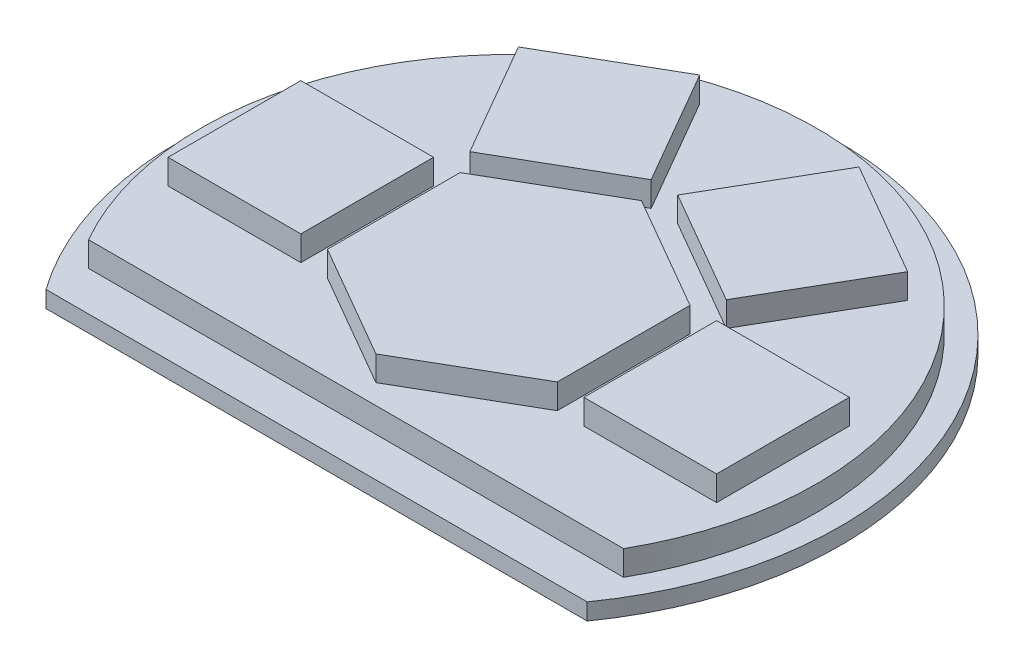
ISO-10303-21;
HEADER;
FILE_DESCRIPTION(('STEP AP214'),'2;1');
FILE_NAME('part.step','',(''),(''),'','','');
FILE_SCHEMA(('AUTOMOTIVE_DESIGN { 1 0 10303 214 1 1 1 1 }'));
ENDSEC;
DATA;
#1=APPLICATION_CONTEXT('core data for automotive mechanical design processes');
#2=APPLICATION_PROTOCOL_DEFINITION('international standard','automotive_design',2000,#1);
#3=PRODUCT_CONTEXT('',#1,'mechanical');
#4=PRODUCT('Part','Part','',(#3));
#5=PRODUCT_RELATED_PRODUCT_CATEGORY('part','',(#4));
#6=PRODUCT_DEFINITION_FORMATION('','',#4);
#7=PRODUCT_DEFINITION_CONTEXT('part definition',#1,'design');
#8=PRODUCT_DEFINITION('design','',#6,#7);
#9=PRODUCT_DEFINITION_SHAPE('','',#8);
#10=(LENGTH_UNIT() NAMED_UNIT(*) SI_UNIT(.MILLI.,.METRE.));
#11=(NAMED_UNIT(*) PLANE_ANGLE_UNIT() SI_UNIT($,.RADIAN.));
#12=(NAMED_UNIT(*) SI_UNIT($,.STERADIAN.) SOLID_ANGLE_UNIT());
#13=UNCERTAINTY_MEASURE_WITH_UNIT(LENGTH_MEASURE(1.E-05),#10,'distance_accuracy_value','');
#14=(GEOMETRIC_REPRESENTATION_CONTEXT(3) GLOBAL_UNCERTAINTY_ASSIGNED_CONTEXT((#13)) GLOBAL_UNIT_ASSIGNED_CONTEXT((#10,
#11,#12)) REPRESENTATION_CONTEXT('',''));
#15=CARTESIAN_POINT('',(0.,0.,0.));
#16=DIRECTION('',(0.,0.,1.));
#17=DIRECTION('',(1.,0.,0.));
#18=AXIS2_PLACEMENT_3D('',#15,#16,#17);
#19=CARTESIAN_POINT('',(0.,15.875,58.42));
#20=DIRECTION('',(0.,0.,1.));
#21=DIRECTION('',(1.,0.,0.));
#22=AXIS2_PLACEMENT_3D('',#19,#20,#21);
#23=PLANE('',#22);
#24=DIRECTION('',(0.,-1.,0.));
#25=VECTOR('',#24,1.);
#26=CARTESIAN_POINT('',(-102.381474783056,15.875,58.42));
#27=LINE('',#26,#25);
#28=CARTESIAN_POINT('',(-102.381474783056,15.875,58.42));
#29=VERTEX_POINT('',#28);
#30=CARTESIAN_POINT('',(-102.381474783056,6.35,58.42));
#31=VERTEX_POINT('',#30);
#32=EDGE_CURVE('E218',#29,#31,#27,.T.);
#33=ORIENTED_EDGE('',*,*,#32,.T.);
#34=DIRECTION('',(-1.,0.,0.));
#35=VECTOR('',#34,1.);
#36=CARTESIAN_POINT('',(0.,6.35,58.42));
#37=LINE('',#36,#35);
#38=CARTESIAN_POINT('',(102.381474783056,6.35,58.42));
#39=VERTEX_POINT('',#38);
#40=EDGE_CURVE('E50',#39,#31,#37,.T.);
#41=ORIENTED_EDGE('',*,*,#40,.F.);
#42=DIRECTION('',(0.,-1.,0.));
#43=VECTOR('',#42,1.);
#44=CARTESIAN_POINT('',(102.381474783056,15.875,58.42));
#45=LINE('',#44,#43);
#46=CARTESIAN_POINT('',(102.381474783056,15.875,58.42));
#47=VERTEX_POINT('',#46);
#48=EDGE_CURVE('E216',#47,#39,#45,.T.);
#49=ORIENTED_EDGE('',*,*,#48,.F.);
#50=DIRECTION('',(-1.,0.,0.));
#51=VECTOR('',#50,1.);
#52=CARTESIAN_POINT('',(0.,15.875,58.42));
#53=LINE('',#52,#51);
#54=EDGE_CURVE('E463',#47,#29,#53,.T.);
#55=ORIENTED_EDGE('',*,*,#54,.T.);
#56=EDGE_LOOP('',(#33,#41,#49,#55));
#57=FACE_BOUND('',#56,.T.);
#58=ADVANCED_FACE('F36',(#57),#23,.T.);
#59=CARTESIAN_POINT('',(0.,15.875,0.));
#60=DIRECTION('',(0.,-1.,0.));
#61=DIRECTION('',(0.,0.,-1.));
#62=AXIS2_PLACEMENT_3D('',#59,#60,#61);
#63=CYLINDRICAL_SURFACE('',#62,117.876472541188);
#64=ORIENTED_EDGE('',*,*,#48,.T.);
#65=CARTESIAN_POINT('',(0.,6.35,0.));
#66=DIRECTION('',(0.,-1.,0.));
#67=DIRECTION('',(0.,0.,-1.));
#68=AXIS2_PLACEMENT_3D('',#65,#66,#67);
#69=CIRCLE('',#68,117.876472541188);
#70=EDGE_CURVE('E206',#31,#39,#69,.T.);
#71=ORIENTED_EDGE('',*,*,#70,.F.);
#72=ORIENTED_EDGE('',*,*,#32,.F.);
#73=CARTESIAN_POINT('',(0.,15.875,0.));
#74=DIRECTION('',(0.,-1.,0.));
#75=DIRECTION('',(0.,0.,-1.));
#76=AXIS2_PLACEMENT_3D('',#73,#74,#75);
#77=CIRCLE('',#76,117.876472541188);
#78=EDGE_CURVE('E224',#29,#47,#77,.T.);
#79=ORIENTED_EDGE('',*,*,#78,.T.);
#80=EDGE_LOOP('',(#64,#71,#72,#79));
#81=FACE_BOUND('',#80,.T.);
#82=ADVANCED_FACE('F222',(#81),#63,.T.);
#83=CARTESIAN_POINT('',(0.,15.875,0.));
#84=DIRECTION('',(0.,-1.,0.));
#85=DIRECTION('',(0.,0.,-1.));
#86=AXIS2_PLACEMENT_3D('',#83,#84,#85);
#87=PLANE('',#86);
#88=DIRECTION('',(0.5,0.,0.866025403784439));
#89=VECTOR('',#88,1.);
#90=CARTESIAN_POINT('',(-21.9970452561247,15.875,12.7));
#91=LINE('',#90,#89);
#92=CARTESIAN_POINT('',(-74.4740905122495,15.875,-78.1929086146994));
#93=VERTEX_POINT('',#92);
#94=CARTESIAN_POINT('',(-49.0740905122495,15.875,-34.1988181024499));
#95=VERTEX_POINT('',#94);
#96=EDGE_CURVE('E380',#93,#95,#91,.T.);
#97=ORIENTED_EDGE('',*,*,#96,.F.);
#98=DIRECTION('',(-0.866025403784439,0.,0.5));
#99=VECTOR('',#98,1.);
#100=CARTESIAN_POINT('',(-52.4770452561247,15.875,-90.8929086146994));
#101=LINE('',#100,#99);
#102=CARTESIAN_POINT('',(-30.48,15.875,-103.592908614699));
#103=VERTEX_POINT('',#102);
#104=EDGE_CURVE('E371',#103,#93,#101,.T.);
#105=ORIENTED_EDGE('',*,*,#104,.F.);
#106=DIRECTION('',(-0.5,0.,-0.866025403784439));
#107=VECTOR('',#106,1.);
#108=CARTESIAN_POINT('',(21.9970452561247,15.875,-12.7));
#109=LINE('',#108,#107);
#110=CARTESIAN_POINT('',(-5.08,15.875,-59.5988181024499));
#111=VERTEX_POINT('',#110);
#112=EDGE_CURVE('E374',#111,#103,#109,.T.);
#113=ORIENTED_EDGE('',*,*,#112,.F.);
#114=DIRECTION('',(0.866025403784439,0.,-0.5));
#115=VECTOR('',#114,1.);
#116=CARTESIAN_POINT('',(-27.0770452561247,15.875,-46.8988181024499));
#117=LINE('',#116,#115);
#118=EDGE_CURVE('E377',#95,#111,#117,.T.);
#119=ORIENTED_EDGE('',*,*,#118,.F.);
#120=EDGE_LOOP('',(#97,#105,#113,#119));
#121=FACE_BOUND('',#120,.T.);
#122=DIRECTION('',(1.,0.,0.));
#123=VECTOR('',#122,1.);
#124=CARTESIAN_POINT('',(-54.1540905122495,15.875,-25.3999999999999));
#125=LINE('',#124,#123);
#126=CARTESIAN_POINT('',(-104.954090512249,15.875,-25.3999999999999));
#127=VERTEX_POINT('',#126);
#128=CARTESIAN_POINT('',(-54.1540905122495,15.875,-25.3999999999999));
#129=VERTEX_POINT('',#128);
#130=EDGE_CURVE('E228',#127,#129,#125,.T.);
#131=ORIENTED_EDGE('',*,*,#130,.T.);
#132=DIRECTION('',(0.,0.,1.));
#133=VECTOR('',#132,1.);
#134=CARTESIAN_POINT('',(-54.1540905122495,15.875,-25.3999999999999));
#135=LINE('',#134,#133);
#136=CARTESIAN_POINT('',(-54.1540905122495,15.875,25.4000000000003));
#137=VERTEX_POINT('',#136);
#138=EDGE_CURVE('E236',#129,#137,#135,.T.);
#139=ORIENTED_EDGE('',*,*,#138,.T.);
#140=DIRECTION('',(-1.,0.,0.));
#141=VECTOR('',#140,1.);
#142=CARTESIAN_POINT('',(-54.1540905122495,15.875,25.4000000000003));
#143=LINE('',#142,#141);
#144=CARTESIAN_POINT('',(-104.954090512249,15.875,25.4000000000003));
#145=VERTEX_POINT('',#144);
#146=EDGE_CURVE('E11',#137,#145,#143,.T.);
#147=ORIENTED_EDGE('',*,*,#146,.T.);
#148=DIRECTION('',(0.,0.,-1.));
#149=VECTOR('',#148,1.);
#150=CARTESIAN_POINT('',(-104.954090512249,15.875,-25.3999999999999));
#151=LINE('',#150,#149);
#152=EDGE_CURVE('E225',#145,#127,#151,.T.);
#153=ORIENTED_EDGE('',*,*,#152,.T.);
#154=EDGE_LOOP('',(#131,#139,#147,#153));
#155=FACE_BOUND('',#154,.T.);
#156=ORIENTED_EDGE('',*,*,#54,.F.);
#157=ORIENTED_EDGE('',*,*,#78,.F.);
#158=EDGE_LOOP('',(#156,#157));
#159=FACE_BOUND('',#158,.T.);
#160=DIRECTION('',(0.866025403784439,0.,0.5));
#161=VECTOR('',#160,1.);
#162=CARTESIAN_POINT('',(21.9970452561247,15.875,-38.1));
#163=LINE('',#162,#161);
#164=CARTESIAN_POINT('',(0.,15.875,-50.8));
#165=VERTEX_POINT('',#164);
#166=CARTESIAN_POINT('',(43.9940905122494,15.875,-25.4000000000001));
#167=VERTEX_POINT('',#166);
#168=EDGE_CURVE('E446',#165,#167,#163,.T.);
#169=ORIENTED_EDGE('',*,*,#168,.T.);
#170=DIRECTION('',(0.,0.,1.));
#171=VECTOR('',#170,1.);
#172=CARTESIAN_POINT('',(43.9940905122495,15.875,0.));
#173=LINE('',#172,#171);
#174=CARTESIAN_POINT('',(43.9940905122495,15.875,25.4));
#175=VERTEX_POINT('',#174);
#176=EDGE_CURVE('E461',#167,#175,#173,.T.);
#177=ORIENTED_EDGE('',*,*,#176,.T.);
#178=DIRECTION('',(-0.866025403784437,0.,0.500000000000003));
#179=VECTOR('',#178,1.);
#180=CARTESIAN_POINT('',(21.9970452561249,15.875,38.1));
#181=LINE('',#180,#179);
#182=CARTESIAN_POINT('',(3.54734504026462E-13,15.875,50.8));
#183=VERTEX_POINT('',#182);
#184=EDGE_CURVE('E458',#175,#183,#181,.T.);
#185=ORIENTED_EDGE('',*,*,#184,.T.);
#186=DIRECTION('',(-0.866025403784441,0.,-0.499999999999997));
#187=VECTOR('',#186,1.);
#188=CARTESIAN_POINT('',(-21.9970452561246,15.875,38.1));
#189=LINE('',#188,#187);
#190=CARTESIAN_POINT('',(-43.9940905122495,15.875,25.4));
#191=VERTEX_POINT('',#190);
#192=EDGE_CURVE('E455',#183,#191,#189,.T.);
#193=ORIENTED_EDGE('',*,*,#192,.T.);
#194=DIRECTION('',(0.,0.,-1.));
#195=VECTOR('',#194,1.);
#196=CARTESIAN_POINT('',(-43.9940905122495,15.875,0.));
#197=LINE('',#196,#195);
#198=CARTESIAN_POINT('',(-43.9940905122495,15.875,-25.4));
#199=VERTEX_POINT('',#198);
#200=EDGE_CURVE('E452',#191,#199,#197,.T.);
#201=ORIENTED_EDGE('',*,*,#200,.T.);
#202=DIRECTION('',(0.866025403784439,0.,-0.5));
#203=VECTOR('',#202,1.);
#204=CARTESIAN_POINT('',(-21.9970452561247,15.875,-38.1));
#205=LINE('',#204,#203);
#206=EDGE_CURVE('E449',#199,#165,#205,.T.);
#207=ORIENTED_EDGE('',*,*,#206,.T.);
#208=EDGE_LOOP('',(#169,#177,#185,#193,#201,#207));
#209=FACE_BOUND('',#208,.T.);
#210=DIRECTION('',(-1.,0.,0.));
#211=VECTOR('',#210,1.);
#212=CARTESIAN_POINT('',(0.,15.875,-25.3999999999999));
#213=LINE('',#212,#211);
#214=CARTESIAN_POINT('',(104.954090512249,15.875,-25.3999999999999));
#215=VERTEX_POINT('',#214);
#216=CARTESIAN_POINT('',(54.1540905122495,15.875,-25.3999999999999));
#217=VERTEX_POINT('',#216);
#218=EDGE_CURVE('E413',#215,#217,#213,.T.);
#219=ORIENTED_EDGE('',*,*,#218,.F.);
#220=DIRECTION('',(0.,0.,-1.));
#221=VECTOR('',#220,1.);
#222=CARTESIAN_POINT('',(104.954090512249,15.875,0.));
#223=LINE('',#222,#221);
#224=CARTESIAN_POINT('',(104.954090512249,15.875,25.4000000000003));
#225=VERTEX_POINT('',#224);
#226=EDGE_CURVE('E404',#225,#215,#223,.T.);
#227=ORIENTED_EDGE('',*,*,#226,.F.);
#228=DIRECTION('',(1.,0.,0.));
#229=VECTOR('',#228,1.);
#230=CARTESIAN_POINT('',(0.,15.875,25.4000000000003));
#231=LINE('',#230,#229);
#232=CARTESIAN_POINT('',(54.1540905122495,15.875,25.4000000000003));
#233=VERTEX_POINT('',#232);
#234=EDGE_CURVE('E407',#233,#225,#231,.T.);
#235=ORIENTED_EDGE('',*,*,#234,.F.);
#236=DIRECTION('',(0.,0.,1.));
#237=VECTOR('',#236,1.);
#238=CARTESIAN_POINT('',(54.1540905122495,15.875,0.));
#239=LINE('',#238,#237);
#240=EDGE_CURVE('E410',#217,#233,#239,.T.);
#241=ORIENTED_EDGE('',*,*,#240,.F.);
#242=EDGE_LOOP('',(#219,#227,#235,#241));
#243=FACE_BOUND('',#242,.T.);
#244=DIRECTION('',(-0.866025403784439,0.,-0.5));
#245=VECTOR('',#244,1.);
#246=CARTESIAN_POINT('',(52.4770452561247,15.875,-90.8929086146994));
#247=LINE('',#246,#245);
#248=CARTESIAN_POINT('',(74.4740905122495,15.875,-78.1929086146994));
#249=VERTEX_POINT('',#248);
#250=CARTESIAN_POINT('',(30.48,15.875,-103.592908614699));
#251=VERTEX_POINT('',#250);
#252=EDGE_CURVE('E348',#249,#251,#247,.T.);
#253=ORIENTED_EDGE('',*,*,#252,.F.);
#254=DIRECTION('',(0.5,0.,-0.866025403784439));
#255=VECTOR('',#254,1.);
#256=CARTESIAN_POINT('',(21.9970452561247,15.875,12.7));
#257=LINE('',#256,#255);
#258=CARTESIAN_POINT('',(49.0740905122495,15.875,-34.1988181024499));
#259=VERTEX_POINT('',#258);
#260=EDGE_CURVE('E341',#259,#249,#257,.T.);
#261=ORIENTED_EDGE('',*,*,#260,.F.);
#262=DIRECTION('',(0.866025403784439,0.,0.5));
#263=VECTOR('',#262,1.);
#264=CARTESIAN_POINT('',(27.0770452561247,15.875,-46.8988181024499));
#265=LINE('',#264,#263);
#266=CARTESIAN_POINT('',(5.08000000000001,15.875,-59.5988181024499));
#267=VERTEX_POINT('',#266);
#268=EDGE_CURVE('E344',#267,#259,#265,.T.);
#269=ORIENTED_EDGE('',*,*,#268,.F.);
#270=DIRECTION('',(-0.5,0.,0.866025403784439));
#271=VECTOR('',#270,1.);
#272=CARTESIAN_POINT('',(-21.9970452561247,15.875,-12.7));
#273=LINE('',#272,#271);
#274=EDGE_CURVE('E58',#251,#267,#273,.T.);
#275=ORIENTED_EDGE('',*,*,#274,.F.);
#276=EDGE_LOOP('',(#253,#261,#269,#275));
#277=FACE_BOUND('',#276,.T.);
#278=ADVANCED_FACE('F263',(#121,#155,#159,#209,#243,#277),#87,.F.);
#279=CARTESIAN_POINT('',(-54.1540905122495,25.4,-25.3999999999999));
#280=DIRECTION('',(-1.,0.,0.));
#281=DIRECTION('',(0.,0.,1.));
#282=AXIS2_PLACEMENT_3D('',#279,#280,#281);
#283=PLANE('',#282);
#284=ORIENTED_EDGE('',*,*,#138,.F.);
#285=DIRECTION('',(0.,-1.,0.));
#286=VECTOR('',#285,1.);
#287=CARTESIAN_POINT('',(-54.1540905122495,25.4,-25.3999999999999));
#288=LINE('',#287,#286);
#289=CARTESIAN_POINT('',(-54.1540905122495,25.4,-25.3999999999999));
#290=VERTEX_POINT('',#289);
#291=EDGE_CURVE('E44',#290,#129,#288,.T.);
#292=ORIENTED_EDGE('',*,*,#291,.F.);
#293=DIRECTION('',(0.,0.,-1.));
#294=VECTOR('',#293,1.);
#295=CARTESIAN_POINT('',(-54.1540905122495,25.4,-25.3999999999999));
#296=LINE('',#295,#294);
#297=CARTESIAN_POINT('',(-54.1540905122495,25.4,25.4000000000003));
#298=VERTEX_POINT('',#297);
#299=EDGE_CURVE('E239',#298,#290,#296,.T.);
#300=ORIENTED_EDGE('',*,*,#299,.F.);
#301=DIRECTION('',(0.,-1.,0.));
#302=VECTOR('',#301,1.);
#303=CARTESIAN_POINT('',(-54.1540905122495,25.4,25.4000000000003));
#304=LINE('',#303,#302);
#305=EDGE_CURVE('E248',#298,#137,#304,.T.);
#306=ORIENTED_EDGE('',*,*,#305,.T.);
#307=EDGE_LOOP('',(#284,#292,#300,#306));
#308=FACE_BOUND('',#307,.T.);
#309=ADVANCED_FACE('F38',(#308),#283,.F.);
#310=CARTESIAN_POINT('',(-54.1540905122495,25.4,-25.3999999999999));
#311=DIRECTION('',(0.,0.,1.));
#312=DIRECTION('',(1.,0.,0.));
#313=AXIS2_PLACEMENT_3D('',#310,#311,#312);
#314=PLANE('',#313);
#315=ORIENTED_EDGE('',*,*,#130,.F.);
#316=DIRECTION('',(0.,-1.,0.));
#317=VECTOR('',#316,1.);
#318=CARTESIAN_POINT('',(-104.954090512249,25.4,-25.3999999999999));
#319=LINE('',#318,#317);
#320=CARTESIAN_POINT('',(-104.954090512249,25.4,-25.3999999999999));
#321=VERTEX_POINT('',#320);
#322=EDGE_CURVE('E253',#321,#127,#319,.T.);
#323=ORIENTED_EDGE('',*,*,#322,.F.);
#324=DIRECTION('',(-1.,0.,0.));
#325=VECTOR('',#324,1.);
#326=CARTESIAN_POINT('',(-54.1540905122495,25.4,-25.3999999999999));
#327=LINE('',#326,#325);
#328=EDGE_CURVE('E242',#290,#321,#327,.T.);
#329=ORIENTED_EDGE('',*,*,#328,.F.);
#330=ORIENTED_EDGE('',*,*,#291,.T.);
#331=EDGE_LOOP('',(#315,#323,#329,#330));
#332=FACE_BOUND('',#331,.T.);
#333=ADVANCED_FACE('F258',(#332),#314,.F.);
#334=CARTESIAN_POINT('',(-104.954090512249,25.4,-25.3999999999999));
#335=DIRECTION('',(1.,0.,0.));
#336=DIRECTION('',(0.,0.,-1.));
#337=AXIS2_PLACEMENT_3D('',#334,#335,#336);
#338=PLANE('',#337);
#339=ORIENTED_EDGE('',*,*,#152,.F.);
#340=DIRECTION('',(0.,-1.,0.));
#341=VECTOR('',#340,1.);
#342=CARTESIAN_POINT('',(-104.954090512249,25.4,25.4000000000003));
#343=LINE('',#342,#341);
#344=CARTESIAN_POINT('',(-104.954090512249,25.4,25.4000000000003));
#345=VERTEX_POINT('',#344);
#346=EDGE_CURVE('E251',#345,#145,#343,.T.);
#347=ORIENTED_EDGE('',*,*,#346,.F.);
#348=DIRECTION('',(0.,0.,1.));
#349=VECTOR('',#348,1.);
#350=CARTESIAN_POINT('',(-104.954090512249,25.4,-25.3999999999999));
#351=LINE('',#350,#349);
#352=EDGE_CURVE('E244',#321,#345,#351,.T.);
#353=ORIENTED_EDGE('',*,*,#352,.F.);
#354=ORIENTED_EDGE('',*,*,#322,.T.);
#355=EDGE_LOOP('',(#339,#347,#353,#354));
#356=FACE_BOUND('',#355,.T.);
#357=ADVANCED_FACE('F268',(#356),#338,.F.);
#358=CARTESIAN_POINT('',(-54.1540905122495,25.4,25.4000000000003));
#359=DIRECTION('',(0.,0.,-1.));
#360=DIRECTION('',(-1.,0.,0.));
#361=AXIS2_PLACEMENT_3D('',#358,#359,#360);
#362=PLANE('',#361);
#363=ORIENTED_EDGE('',*,*,#146,.F.);
#364=ORIENTED_EDGE('',*,*,#305,.F.);
#365=DIRECTION('',(1.,0.,0.));
#366=VECTOR('',#365,1.);
#367=CARTESIAN_POINT('',(-54.1540905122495,25.4,25.4000000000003));
#368=LINE('',#367,#366);
#369=EDGE_CURVE('E246',#345,#298,#368,.T.);
#370=ORIENTED_EDGE('',*,*,#369,.F.);
#371=ORIENTED_EDGE('',*,*,#346,.T.);
#372=EDGE_LOOP('',(#363,#364,#370,#371));
#373=FACE_BOUND('',#372,.T.);
#374=ADVANCED_FACE('F275',(#373),#362,.F.);
#375=CARTESIAN_POINT('',(0.,25.4,0.));
#376=DIRECTION('',(0.,-1.,0.));
#377=DIRECTION('',(0.,0.,-1.));
#378=AXIS2_PLACEMENT_3D('',#375,#376,#377);
#379=PLANE('',#378);
#380=ORIENTED_EDGE('',*,*,#299,.T.);
#381=ORIENTED_EDGE('',*,*,#328,.T.);
#382=ORIENTED_EDGE('',*,*,#352,.T.);
#383=ORIENTED_EDGE('',*,*,#369,.T.);
#384=EDGE_LOOP('',(#380,#381,#382,#383));
#385=FACE_BOUND('',#384,.T.);
#386=ADVANCED_FACE('F272',(#385),#379,.F.);
#387=CARTESIAN_POINT('',(43.9940905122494,25.4,-25.4000000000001));
#388=DIRECTION('',(-0.5,0.,0.866025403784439));
#389=DIRECTION('',(0.866025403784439,0.,0.5));
#390=AXIS2_PLACEMENT_3D('',#387,#388,#389);
#391=PLANE('',#390);
#392=DIRECTION('',(0.,-1.,0.));
#393=VECTOR('',#392,1.);
#394=CARTESIAN_POINT('',(43.9940905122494,25.4,-25.4000000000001));
#395=LINE('',#394,#393);
#396=CARTESIAN_POINT('',(43.9940905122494,25.4,-25.4000000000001));
#397=VERTEX_POINT('',#396);
#398=EDGE_CURVE('E429',#397,#167,#395,.T.);
#399=ORIENTED_EDGE('',*,*,#398,.T.);
#400=ORIENTED_EDGE('',*,*,#168,.F.);
#401=DIRECTION('',(0.,-1.,0.));
#402=VECTOR('',#401,1.);
#403=CARTESIAN_POINT('',(0.,25.4,-50.8));
#404=LINE('',#403,#402);
#405=CARTESIAN_POINT('',(0.,25.4,-50.8));
#406=VERTEX_POINT('',#405);
#407=EDGE_CURVE('E443',#406,#165,#404,.T.);
#408=ORIENTED_EDGE('',*,*,#407,.F.);
#409=DIRECTION('',(-0.866025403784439,0.,-0.5));
#410=VECTOR('',#409,1.);
#411=CARTESIAN_POINT('',(43.9940905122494,25.4,-25.4000000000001));
#412=LINE('',#411,#410);
#413=EDGE_CURVE('E416',#397,#406,#412,.T.);
#414=ORIENTED_EDGE('',*,*,#413,.F.);
#415=EDGE_LOOP('',(#399,#400,#408,#414));
#416=FACE_BOUND('',#415,.T.);
#417=ADVANCED_FACE('F282',(#416),#391,.F.);
#418=CARTESIAN_POINT('',(0.,25.4,-50.8));
#419=DIRECTION('',(0.5,0.,0.866025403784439));
#420=DIRECTION('',(0.866025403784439,0.,-0.5));
#421=AXIS2_PLACEMENT_3D('',#418,#419,#420);
#422=PLANE('',#421);
#423=ORIENTED_EDGE('',*,*,#407,.T.);
#424=ORIENTED_EDGE('',*,*,#206,.F.);
#425=DIRECTION('',(0.,-1.,0.));
#426=VECTOR('',#425,1.);
#427=CARTESIAN_POINT('',(-43.9940905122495,25.4,-25.4));
#428=LINE('',#427,#426);
#429=CARTESIAN_POINT('',(-43.9940905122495,25.4,-25.4));
#430=VERTEX_POINT('',#429);
#431=EDGE_CURVE('E440',#430,#199,#428,.T.);
#432=ORIENTED_EDGE('',*,*,#431,.F.);
#433=DIRECTION('',(-0.866025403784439,0.,0.5));
#434=VECTOR('',#433,1.);
#435=CARTESIAN_POINT('',(0.,25.4,-50.8));
#436=LINE('',#435,#434);
#437=EDGE_CURVE('E419',#406,#430,#436,.T.);
#438=ORIENTED_EDGE('',*,*,#437,.F.);
#439=EDGE_LOOP('',(#423,#424,#432,#438));
#440=FACE_BOUND('',#439,.T.);
#441=ADVANCED_FACE('F554',(#440),#422,.F.);
#442=CARTESIAN_POINT('',(-43.9940905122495,25.4,-25.4));
#443=DIRECTION('',(1.,0.,0.));
#444=DIRECTION('',(0.,0.,-1.));
#445=AXIS2_PLACEMENT_3D('',#442,#443,#444);
#446=PLANE('',#445);
#447=ORIENTED_EDGE('',*,*,#431,.T.);
#448=ORIENTED_EDGE('',*,*,#200,.F.);
#449=DIRECTION('',(0.,-1.,0.));
#450=VECTOR('',#449,1.);
#451=CARTESIAN_POINT('',(-43.9940905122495,25.4,25.4));
#452=LINE('',#451,#450);
#453=CARTESIAN_POINT('',(-43.9940905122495,25.4,25.4));
#454=VERTEX_POINT('',#453);
#455=EDGE_CURVE('E437',#454,#191,#452,.T.);
#456=ORIENTED_EDGE('',*,*,#455,.F.);
#457=DIRECTION('',(0.,0.,1.));
#458=VECTOR('',#457,1.);
#459=CARTESIAN_POINT('',(-43.9940905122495,25.4,-25.4));
#460=LINE('',#459,#458);
#461=EDGE_CURVE('E421',#430,#454,#460,.T.);
#462=ORIENTED_EDGE('',*,*,#461,.F.);
#463=EDGE_LOOP('',(#447,#448,#456,#462));
#464=FACE_BOUND('',#463,.T.);
#465=ADVANCED_FACE('F550',(#464),#446,.F.);
#466=CARTESIAN_POINT('',(-43.9940905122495,25.4,25.4));
#467=DIRECTION('',(0.499999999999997,0.,-0.866025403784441));
#468=DIRECTION('',(-0.866025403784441,0.,-0.499999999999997));
#469=AXIS2_PLACEMENT_3D('',#466,#467,#468);
#470=PLANE('',#469);
#471=ORIENTED_EDGE('',*,*,#455,.T.);
#472=ORIENTED_EDGE('',*,*,#192,.F.);
#473=DIRECTION('',(0.,-1.,0.));
#474=VECTOR('',#473,1.);
#475=CARTESIAN_POINT('',(3.54734504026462E-13,25.4,50.8));
#476=LINE('',#475,#474);
#477=CARTESIAN_POINT('',(3.54734504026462E-13,25.4,50.8));
#478=VERTEX_POINT('',#477);
#479=EDGE_CURVE('E434',#478,#183,#476,.T.);
#480=ORIENTED_EDGE('',*,*,#479,.F.);
#481=DIRECTION('',(0.866025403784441,0.,0.499999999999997));
#482=VECTOR('',#481,1.);
#483=CARTESIAN_POINT('',(-43.9940905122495,25.4,25.4));
#484=LINE('',#483,#482);
#485=EDGE_CURVE('E423',#454,#478,#484,.T.);
#486=ORIENTED_EDGE('',*,*,#485,.F.);
#487=EDGE_LOOP('',(#471,#472,#480,#486));
#488=FACE_BOUND('',#487,.T.);
#489=ADVANCED_FACE('F546',(#488),#470,.F.);
#490=CARTESIAN_POINT('',(3.54734504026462E-13,25.4,50.8));
#491=DIRECTION('',(-0.500000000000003,0.,-0.866025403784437));
#492=DIRECTION('',(-0.866025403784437,0.,0.500000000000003));
#493=AXIS2_PLACEMENT_3D('',#490,#491,#492);
#494=PLANE('',#493);
#495=ORIENTED_EDGE('',*,*,#479,.T.);
#496=ORIENTED_EDGE('',*,*,#184,.F.);
#497=DIRECTION('',(0.,-1.,0.));
#498=VECTOR('',#497,1.);
#499=CARTESIAN_POINT('',(43.9940905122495,25.4,25.4));
#500=LINE('',#499,#498);
#501=CARTESIAN_POINT('',(43.9940905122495,25.4,25.4));
#502=VERTEX_POINT('',#501);
#503=EDGE_CURVE('E432',#502,#175,#500,.T.);
#504=ORIENTED_EDGE('',*,*,#503,.F.);
#505=DIRECTION('',(0.866025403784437,0.,-0.500000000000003));
#506=VECTOR('',#505,1.);
#507=CARTESIAN_POINT('',(3.54734504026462E-13,25.4,50.8));
#508=LINE('',#507,#506);
#509=EDGE_CURVE('E425',#478,#502,#508,.T.);
#510=ORIENTED_EDGE('',*,*,#509,.F.);
#511=EDGE_LOOP('',(#495,#496,#504,#510));
#512=FACE_BOUND('',#511,.T.);
#513=ADVANCED_FACE('F542',(#512),#494,.F.);
#514=CARTESIAN_POINT('',(43.9940905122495,25.4,25.4));
#515=DIRECTION('',(-1.,0.,0.));
#516=DIRECTION('',(0.,0.,1.));
#517=AXIS2_PLACEMENT_3D('',#514,#515,#516);
#518=PLANE('',#517);
#519=ORIENTED_EDGE('',*,*,#503,.T.);
#520=ORIENTED_EDGE('',*,*,#176,.F.);
#521=ORIENTED_EDGE('',*,*,#398,.F.);
#522=DIRECTION('',(0.,0.,-1.));
#523=VECTOR('',#522,1.);
#524=CARTESIAN_POINT('',(43.9940905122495,25.4,25.4));
#525=LINE('',#524,#523);
#526=EDGE_CURVE('E427',#502,#397,#525,.T.);
#527=ORIENTED_EDGE('',*,*,#526,.F.);
#528=EDGE_LOOP('',(#519,#520,#521,#527));
#529=FACE_BOUND('',#528,.T.);
#530=ADVANCED_FACE('F538',(#529),#518,.F.);
#531=CARTESIAN_POINT('',(0.,25.4,0.));
#532=DIRECTION('',(0.,1.,0.));
#533=DIRECTION('',(0.,0.,1.));
#534=AXIS2_PLACEMENT_3D('',#531,#532,#533);
#535=PLANE('',#534);
#536=ORIENTED_EDGE('',*,*,#413,.T.);
#537=ORIENTED_EDGE('',*,*,#437,.T.);
#538=ORIENTED_EDGE('',*,*,#461,.T.);
#539=ORIENTED_EDGE('',*,*,#485,.T.);
#540=ORIENTED_EDGE('',*,*,#509,.T.);
#541=ORIENTED_EDGE('',*,*,#526,.T.);
#542=EDGE_LOOP('',(#536,#537,#538,#539,#540,#541));
#543=FACE_BOUND('',#542,.T.);
#544=ADVANCED_FACE('F534',(#543),#535,.T.);
#545=CARTESIAN_POINT('',(54.1540905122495,25.4,-25.3999999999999));
#546=DIRECTION('',(0.,0.,1.));
#547=DIRECTION('',(1.,0.,0.));
#548=AXIS2_PLACEMENT_3D('',#545,#546,#547);
#549=PLANE('',#548);
#550=DIRECTION('',(0.,-1.,0.));
#551=VECTOR('',#550,1.);
#552=CARTESIAN_POINT('',(104.954090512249,25.4,-25.3999999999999));
#553=LINE('',#552,#551);
#554=CARTESIAN_POINT('',(104.954090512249,25.4,-25.3999999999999));
#555=VERTEX_POINT('',#554);
#556=EDGE_CURVE('E392',#555,#215,#553,.T.);
#557=ORIENTED_EDGE('',*,*,#556,.T.);
#558=ORIENTED_EDGE('',*,*,#218,.T.);
#559=DIRECTION('',(0.,-1.,0.));
#560=VECTOR('',#559,1.);
#561=CARTESIAN_POINT('',(54.1540905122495,25.4,-25.3999999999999));
#562=LINE('',#561,#560);
#563=CARTESIAN_POINT('',(54.1540905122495,25.4,-25.3999999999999));
#564=VERTEX_POINT('',#563);
#565=EDGE_CURVE('E401',#564,#217,#562,.T.);
#566=ORIENTED_EDGE('',*,*,#565,.F.);
#567=DIRECTION('',(-1.,0.,0.));
#568=VECTOR('',#567,1.);
#569=CARTESIAN_POINT('',(54.1540905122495,25.4,-25.3999999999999));
#570=LINE('',#569,#568);
#571=EDGE_CURVE('E383',#555,#564,#570,.T.);
#572=ORIENTED_EDGE('',*,*,#571,.F.);
#573=EDGE_LOOP('',(#557,#558,#566,#572));
#574=FACE_BOUND('',#573,.T.);
#575=ADVANCED_FACE('F530',(#574),#549,.F.);
#576=CARTESIAN_POINT('',(54.1540905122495,25.4,-25.3999999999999));
#577=DIRECTION('',(1.,0.,0.));
#578=DIRECTION('',(0.,0.,-1.));
#579=AXIS2_PLACEMENT_3D('',#576,#577,#578);
#580=PLANE('',#579);
#581=ORIENTED_EDGE('',*,*,#565,.T.);
#582=ORIENTED_EDGE('',*,*,#240,.T.);
#583=DIRECTION('',(0.,-1.,0.));
#584=VECTOR('',#583,1.);
#585=CARTESIAN_POINT('',(54.1540905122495,25.4,25.4000000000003));
#586=LINE('',#585,#584);
#587=CARTESIAN_POINT('',(54.1540905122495,25.4,25.4000000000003));
#588=VERTEX_POINT('',#587);
#589=EDGE_CURVE('E398',#588,#233,#586,.T.);
#590=ORIENTED_EDGE('',*,*,#589,.F.);
#591=DIRECTION('',(0.,0.,1.));
#592=VECTOR('',#591,1.);
#593=CARTESIAN_POINT('',(54.1540905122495,25.4,-25.3999999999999));
#594=LINE('',#593,#592);
#595=EDGE_CURVE('E386',#564,#588,#594,.T.);
#596=ORIENTED_EDGE('',*,*,#595,.F.);
#597=EDGE_LOOP('',(#581,#582,#590,#596));
#598=FACE_BOUND('',#597,.T.);
#599=ADVANCED_FACE('F526',(#598),#580,.F.);
#600=CARTESIAN_POINT('',(54.1540905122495,25.4,25.4000000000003));
#601=DIRECTION('',(0.,0.,-1.));
#602=DIRECTION('',(-1.,0.,0.));
#603=AXIS2_PLACEMENT_3D('',#600,#601,#602);
#604=PLANE('',#603);
#605=ORIENTED_EDGE('',*,*,#589,.T.);
#606=ORIENTED_EDGE('',*,*,#234,.T.);
#607=DIRECTION('',(0.,-1.,0.));
#608=VECTOR('',#607,1.);
#609=CARTESIAN_POINT('',(104.954090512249,25.4,25.4000000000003));
#610=LINE('',#609,#608);
#611=CARTESIAN_POINT('',(104.954090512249,25.4,25.4000000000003));
#612=VERTEX_POINT('',#611);
#613=EDGE_CURVE('E395',#612,#225,#610,.T.);
#614=ORIENTED_EDGE('',*,*,#613,.F.);
#615=DIRECTION('',(1.,0.,0.));
#616=VECTOR('',#615,1.);
#617=CARTESIAN_POINT('',(54.1540905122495,25.4,25.4000000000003));
#618=LINE('',#617,#616);
#619=EDGE_CURVE('E388',#588,#612,#618,.T.);
#620=ORIENTED_EDGE('',*,*,#619,.F.);
#621=EDGE_LOOP('',(#605,#606,#614,#620));
#622=FACE_BOUND('',#621,.T.);
#623=ADVANCED_FACE('F522',(#622),#604,.F.);
#624=CARTESIAN_POINT('',(104.954090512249,25.4,-25.3999999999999));
#625=DIRECTION('',(-1.,0.,0.));
#626=DIRECTION('',(0.,0.,1.));
#627=AXIS2_PLACEMENT_3D('',#624,#625,#626);
#628=PLANE('',#627);
#629=ORIENTED_EDGE('',*,*,#613,.T.);
#630=ORIENTED_EDGE('',*,*,#226,.T.);
#631=ORIENTED_EDGE('',*,*,#556,.F.);
#632=DIRECTION('',(0.,0.,-1.));
#633=VECTOR('',#632,1.);
#634=CARTESIAN_POINT('',(104.954090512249,25.4,-25.3999999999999));
#635=LINE('',#634,#633);
#636=EDGE_CURVE('E390',#612,#555,#635,.T.);
#637=ORIENTED_EDGE('',*,*,#636,.F.);
#638=EDGE_LOOP('',(#629,#630,#631,#637));
#639=FACE_BOUND('',#638,.T.);
#640=ADVANCED_FACE('F518',(#639),#628,.F.);
#641=CARTESIAN_POINT('',(0.,25.4,0.));
#642=DIRECTION('',(0.,-1.,0.));
#643=DIRECTION('',(0.,0.,-1.));
#644=AXIS2_PLACEMENT_3D('',#641,#642,#643);
#645=PLANE('',#644);
#646=ORIENTED_EDGE('',*,*,#571,.T.);
#647=ORIENTED_EDGE('',*,*,#595,.T.);
#648=ORIENTED_EDGE('',*,*,#619,.T.);
#649=ORIENTED_EDGE('',*,*,#636,.T.);
#650=EDGE_LOOP('',(#646,#647,#648,#649));
#651=FACE_BOUND('',#650,.T.);
#652=ADVANCED_FACE('F514',(#651),#645,.F.);
#653=CARTESIAN_POINT('',(-74.4740905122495,25.4,-78.1929086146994));
#654=DIRECTION('',(0.866025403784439,0.,-0.5));
#655=DIRECTION('',(-0.5,0.,-0.866025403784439));
#656=AXIS2_PLACEMENT_3D('',#653,#654,#655);
#657=PLANE('',#656);
#658=DIRECTION('',(0.,-1.,0.));
#659=VECTOR('',#658,1.);
#660=CARTESIAN_POINT('',(-74.4740905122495,25.4,-78.1929086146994));
#661=LINE('',#660,#659);
#662=CARTESIAN_POINT('',(-74.4740905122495,25.4,-78.1929086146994));
#663=VERTEX_POINT('',#662);
#664=EDGE_CURVE('E359',#663,#93,#661,.T.);
#665=ORIENTED_EDGE('',*,*,#664,.T.);
#666=ORIENTED_EDGE('',*,*,#96,.T.);
#667=DIRECTION('',(0.,-1.,0.));
#668=VECTOR('',#667,1.);
#669=CARTESIAN_POINT('',(-49.0740905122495,25.4,-34.1988181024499));
#670=LINE('',#669,#668);
#671=CARTESIAN_POINT('',(-49.0740905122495,25.4,-34.1988181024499));
#672=VERTEX_POINT('',#671);
#673=EDGE_CURVE('E368',#672,#95,#670,.T.);
#674=ORIENTED_EDGE('',*,*,#673,.F.);
#675=DIRECTION('',(0.5,0.,0.866025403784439));
#676=VECTOR('',#675,1.);
#677=CARTESIAN_POINT('',(-74.4740905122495,25.4,-78.1929086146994));
#678=LINE('',#677,#676);
#679=EDGE_CURVE('E350',#663,#672,#678,.T.);
#680=ORIENTED_EDGE('',*,*,#679,.F.);
#681=EDGE_LOOP('',(#665,#666,#674,#680));
#682=FACE_BOUND('',#681,.T.);
#683=ADVANCED_FACE('F510',(#682),#657,.F.);
#684=CARTESIAN_POINT('',(-49.0740905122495,25.4,-34.1988181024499));
#685=DIRECTION('',(-0.5,0.,-0.866025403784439));
#686=DIRECTION('',(-0.866025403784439,0.,0.5));
#687=AXIS2_PLACEMENT_3D('',#684,#685,#686);
#688=PLANE('',#687);
#689=ORIENTED_EDGE('',*,*,#673,.T.);
#690=ORIENTED_EDGE('',*,*,#118,.T.);
#691=DIRECTION('',(0.,-1.,0.));
#692=VECTOR('',#691,1.);
#693=CARTESIAN_POINT('',(-5.08000000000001,25.4,-59.5988181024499));
#694=LINE('',#693,#692);
#695=CARTESIAN_POINT('',(-5.08000000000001,25.4,-59.5988181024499));
#696=VERTEX_POINT('',#695);
#697=EDGE_CURVE('E365',#696,#111,#694,.T.);
#698=ORIENTED_EDGE('',*,*,#697,.F.);
#699=DIRECTION('',(0.866025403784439,0.,-0.5));
#700=VECTOR('',#699,1.);
#701=CARTESIAN_POINT('',(-49.0740905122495,25.4,-34.1988181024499));
#702=LINE('',#701,#700);
#703=EDGE_CURVE('E353',#672,#696,#702,.T.);
#704=ORIENTED_EDGE('',*,*,#703,.F.);
#705=EDGE_LOOP('',(#689,#690,#698,#704));
#706=FACE_BOUND('',#705,.T.);
#707=ADVANCED_FACE('F506',(#706),#688,.F.);
#708=CARTESIAN_POINT('',(-30.48,25.4,-103.592908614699));
#709=DIRECTION('',(-0.866025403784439,0.,0.5));
#710=DIRECTION('',(0.5,0.,0.866025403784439));
#711=AXIS2_PLACEMENT_3D('',#708,#709,#710);
#712=PLANE('',#711);
#713=ORIENTED_EDGE('',*,*,#697,.T.);
#714=ORIENTED_EDGE('',*,*,#112,.T.);
#715=DIRECTION('',(0.,-1.,0.));
#716=VECTOR('',#715,1.);
#717=CARTESIAN_POINT('',(-30.48,25.4,-103.592908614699));
#718=LINE('',#717,#716);
#719=CARTESIAN_POINT('',(-30.48,25.4,-103.592908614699));
#720=VERTEX_POINT('',#719);
#721=EDGE_CURVE('E362',#720,#103,#718,.T.);
#722=ORIENTED_EDGE('',*,*,#721,.F.);
#723=DIRECTION('',(-0.5,0.,-0.866025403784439));
#724=VECTOR('',#723,1.);
#725=CARTESIAN_POINT('',(-30.48,25.4,-103.592908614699));
#726=LINE('',#725,#724);
#727=EDGE_CURVE('E355',#696,#720,#726,.T.);
#728=ORIENTED_EDGE('',*,*,#727,.F.);
#729=EDGE_LOOP('',(#713,#714,#722,#728));
#730=FACE_BOUND('',#729,.T.);
#731=ADVANCED_FACE('F502',(#730),#712,.F.);
#732=CARTESIAN_POINT('',(-74.4740905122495,25.4,-78.1929086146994));
#733=DIRECTION('',(0.5,0.,0.866025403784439));
#734=DIRECTION('',(0.866025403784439,0.,-0.5));
#735=AXIS2_PLACEMENT_3D('',#732,#733,#734);
#736=PLANE('',#735);
#737=ORIENTED_EDGE('',*,*,#721,.T.);
#738=ORIENTED_EDGE('',*,*,#104,.T.);
#739=ORIENTED_EDGE('',*,*,#664,.F.);
#740=DIRECTION('',(-0.866025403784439,0.,0.5));
#741=VECTOR('',#740,1.);
#742=CARTESIAN_POINT('',(-74.4740905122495,25.4,-78.1929086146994));
#743=LINE('',#742,#741);
#744=EDGE_CURVE('E357',#720,#663,#743,.T.);
#745=ORIENTED_EDGE('',*,*,#744,.F.);
#746=EDGE_LOOP('',(#737,#738,#739,#745));
#747=FACE_BOUND('',#746,.T.);
#748=ADVANCED_FACE('F498',(#747),#736,.F.);
#749=CARTESIAN_POINT('',(0.,25.4,0.));
#750=DIRECTION('',(0.,1.,0.));
#751=DIRECTION('',(0.,0.,1.));
#752=AXIS2_PLACEMENT_3D('',#749,#750,#751);
#753=PLANE('',#752);
#754=ORIENTED_EDGE('',*,*,#679,.T.);
#755=ORIENTED_EDGE('',*,*,#703,.T.);
#756=ORIENTED_EDGE('',*,*,#727,.T.);
#757=ORIENTED_EDGE('',*,*,#744,.T.);
#758=EDGE_LOOP('',(#754,#755,#756,#757));
#759=FACE_BOUND('',#758,.T.);
#760=ADVANCED_FACE('F492',(#759),#753,.T.);
#761=CARTESIAN_POINT('',(74.4740905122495,25.4,-78.1929086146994));
#762=DIRECTION('',(-0.5,0.,0.866025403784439));
#763=DIRECTION('',(0.866025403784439,0.,0.5));
#764=AXIS2_PLACEMENT_3D('',#761,#762,#763);
#765=PLANE('',#764);
#766=DIRECTION('',(0.,-1.,0.));
#767=VECTOR('',#766,1.);
#768=CARTESIAN_POINT('',(74.4740905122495,25.4,-78.1929086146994));
#769=LINE('',#768,#767);
#770=CARTESIAN_POINT('',(74.4740905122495,25.4,-78.1929086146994));
#771=VERTEX_POINT('',#770);
#772=EDGE_CURVE('E329',#771,#249,#769,.T.);
#773=ORIENTED_EDGE('',*,*,#772,.T.);
#774=ORIENTED_EDGE('',*,*,#252,.T.);
#775=DIRECTION('',(0.,-1.,0.));
#776=VECTOR('',#775,1.);
#777=CARTESIAN_POINT('',(30.48,25.4,-103.592908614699));
#778=LINE('',#777,#776);
#779=CARTESIAN_POINT('',(30.48,25.4,-103.592908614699));
#780=VERTEX_POINT('',#779);
#781=EDGE_CURVE('E338',#780,#251,#778,.T.);
#782=ORIENTED_EDGE('',*,*,#781,.F.);
#783=DIRECTION('',(-0.866025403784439,0.,-0.5));
#784=VECTOR('',#783,1.);
#785=CARTESIAN_POINT('',(74.4740905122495,25.4,-78.1929086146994));
#786=LINE('',#785,#784);
#787=EDGE_CURVE('E318',#771,#780,#786,.T.);
#788=ORIENTED_EDGE('',*,*,#787,.F.);
#789=EDGE_LOOP('',(#773,#774,#782,#788));
#790=FACE_BOUND('',#789,.T.);
#791=ADVANCED_FACE('F476',(#790),#765,.F.);
#792=CARTESIAN_POINT('',(30.48,25.4,-103.592908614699));
#793=DIRECTION('',(0.866025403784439,0.,0.5));
#794=DIRECTION('',(0.5,0.,-0.866025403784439));
#795=AXIS2_PLACEMENT_3D('',#792,#793,#794);
#796=PLANE('',#795);
#797=ORIENTED_EDGE('',*,*,#781,.T.);
#798=ORIENTED_EDGE('',*,*,#274,.T.);
#799=DIRECTION('',(0.,-1.,0.));
#800=VECTOR('',#799,1.);
#801=CARTESIAN_POINT('',(5.08000000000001,25.4,-59.5988181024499));
#802=LINE('',#801,#800);
#803=CARTESIAN_POINT('',(5.08000000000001,25.4,-59.5988181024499));
#804=VERTEX_POINT('',#803);
#805=EDGE_CURVE('E335',#804,#267,#802,.T.);
#806=ORIENTED_EDGE('',*,*,#805,.F.);
#807=DIRECTION('',(-0.5,0.,0.866025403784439));
#808=VECTOR('',#807,1.);
#809=CARTESIAN_POINT('',(30.48,25.4,-103.592908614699));
#810=LINE('',#809,#808);
#811=EDGE_CURVE('E323',#780,#804,#810,.T.);
#812=ORIENTED_EDGE('',*,*,#811,.F.);
#813=EDGE_LOOP('',(#797,#798,#806,#812));
#814=FACE_BOUND('',#813,.T.);
#815=ADVANCED_FACE('F484',(#814),#796,.F.);
#816=CARTESIAN_POINT('',(49.0740905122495,25.4,-34.1988181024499));
#817=DIRECTION('',(0.5,0.,-0.866025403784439));
#818=DIRECTION('',(-0.866025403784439,0.,-0.5));
#819=AXIS2_PLACEMENT_3D('',#816,#817,#818);
#820=PLANE('',#819);
#821=ORIENTED_EDGE('',*,*,#805,.T.);
#822=ORIENTED_EDGE('',*,*,#268,.T.);
#823=DIRECTION('',(0.,-1.,0.));
#824=VECTOR('',#823,1.);
#825=CARTESIAN_POINT('',(49.0740905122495,25.4,-34.1988181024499));
#826=LINE('',#825,#824);
#827=CARTESIAN_POINT('',(49.0740905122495,25.4,-34.1988181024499));
#828=VERTEX_POINT('',#827);
#829=EDGE_CURVE('E332',#828,#259,#826,.T.);
#830=ORIENTED_EDGE('',*,*,#829,.F.);
#831=DIRECTION('',(0.866025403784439,0.,0.5));
#832=VECTOR('',#831,1.);
#833=CARTESIAN_POINT('',(49.0740905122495,25.4,-34.1988181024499));
#834=LINE('',#833,#832);
#835=EDGE_CURVE('E325',#804,#828,#834,.T.);
#836=ORIENTED_EDGE('',*,*,#835,.F.);
#837=EDGE_LOOP('',(#821,#822,#830,#836));
#838=FACE_BOUND('',#837,.T.);
#839=ADVANCED_FACE('F482',(#838),#820,.F.);
#840=CARTESIAN_POINT('',(74.4740905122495,25.4,-78.1929086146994));
#841=DIRECTION('',(-0.866025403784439,0.,-0.5));
#842=DIRECTION('',(-0.5,0.,0.866025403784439));
#843=AXIS2_PLACEMENT_3D('',#840,#841,#842);
#844=PLANE('',#843);
#845=ORIENTED_EDGE('',*,*,#829,.T.);
#846=ORIENTED_EDGE('',*,*,#260,.T.);
#847=ORIENTED_EDGE('',*,*,#772,.F.);
#848=DIRECTION('',(0.5,0.,-0.866025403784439));
#849=VECTOR('',#848,1.);
#850=CARTESIAN_POINT('',(74.4740905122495,25.4,-78.1929086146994));
#851=LINE('',#850,#849);
#852=EDGE_CURVE('E327',#828,#771,#851,.T.);
#853=ORIENTED_EDGE('',*,*,#852,.F.);
#854=EDGE_LOOP('',(#845,#846,#847,#853));
#855=FACE_BOUND('',#854,.T.);
#856=ADVANCED_FACE('F472',(#855),#844,.F.);
#857=CARTESIAN_POINT('',(0.,25.4,0.));
#858=DIRECTION('',(0.,1.,0.));
#859=DIRECTION('',(0.,0.,1.));
#860=AXIS2_PLACEMENT_3D('',#857,#858,#859);
#861=PLANE('',#860);
#862=ORIENTED_EDGE('',*,*,#787,.T.);
#863=ORIENTED_EDGE('',*,*,#811,.T.);
#864=ORIENTED_EDGE('',*,*,#835,.T.);
#865=ORIENTED_EDGE('',*,*,#852,.T.);
#866=EDGE_LOOP('',(#862,#863,#864,#865));
#867=FACE_BOUND('',#866,.T.);
#868=ADVANCED_FACE('F478',(#867),#861,.T.);
#869=CARTESIAN_POINT('',(0.,6.35,73.5249618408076));
#870=DIRECTION('',(0.,0.,-1.));
#871=DIRECTION('',(-1.,0.,0.));
#872=AXIS2_PLACEMENT_3D('',#869,#870,#871);
#873=PLANE('',#872);
#874=DIRECTION('',(1.,0.,0.));
#875=VECTOR('',#874,1.);
#876=CARTESIAN_POINT('',(0.,0.,73.5249618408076));
#877=LINE('',#876,#875);
#878=CARTESIAN_POINT('',(-103.552305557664,0.,73.5249618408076));
#879=VERTEX_POINT('',#878);
#880=CARTESIAN_POINT('',(103.552305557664,0.,73.5249618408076));
#881=VERTEX_POINT('',#880);
#882=EDGE_CURVE('E304',#879,#881,#877,.T.);
#883=ORIENTED_EDGE('',*,*,#882,.T.);
#884=DIRECTION('',(0.,-1.,0.));
#885=VECTOR('',#884,1.);
#886=CARTESIAN_POINT('',(103.552305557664,6.35,73.5249618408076));
#887=LINE('',#886,#885);
#888=CARTESIAN_POINT('',(103.552305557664,6.35,73.5249618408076));
#889=VERTEX_POINT('',#888);
#890=EDGE_CURVE('E313',#889,#881,#887,.T.);
#891=ORIENTED_EDGE('',*,*,#890,.F.);
#892=DIRECTION('',(1.,0.,0.));
#893=VECTOR('',#892,1.);
#894=CARTESIAN_POINT('',(0.,6.35,73.5249618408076));
#895=LINE('',#894,#893);
#896=CARTESIAN_POINT('',(-103.552305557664,6.35,73.5249618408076));
#897=VERTEX_POINT('',#896);
#898=EDGE_CURVE('E212',#897,#889,#895,.T.);
#899=ORIENTED_EDGE('',*,*,#898,.F.);
#900=DIRECTION('',(0.,-1.,0.));
#901=VECTOR('',#900,1.);
#902=CARTESIAN_POINT('',(-103.552305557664,6.35,73.5249618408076));
#903=LINE('',#902,#901);
#904=EDGE_CURVE('E311',#897,#879,#903,.T.);
#905=ORIENTED_EDGE('',*,*,#904,.T.);
#906=EDGE_LOOP('',(#883,#891,#899,#905));
#907=FACE_BOUND('',#906,.T.);
#908=ADVANCED_FACE('F670',(#907),#873,.F.);
#909=CARTESIAN_POINT('',(0.,6.35,0.));
#910=DIRECTION('',(0.,-1.,0.));
#911=DIRECTION('',(0.,0.,-1.));
#912=AXIS2_PLACEMENT_3D('',#909,#910,#911);
#913=CYLINDRICAL_SURFACE('',#912,127.);
#914=CARTESIAN_POINT('',(0.,0.,0.));
#915=DIRECTION('',(0.,-1.,0.));
#916=DIRECTION('',(0.,0.,-1.));
#917=AXIS2_PLACEMENT_3D('',#914,#915,#916);
#918=CIRCLE('',#917,127.);
#919=EDGE_CURVE('E219',#879,#881,#918,.T.);
#920=ORIENTED_EDGE('',*,*,#919,.F.);
#921=ORIENTED_EDGE('',*,*,#904,.F.);
#922=CARTESIAN_POINT('',(0.,6.35,0.));
#923=DIRECTION('',(0.,-1.,0.));
#924=DIRECTION('',(0.,0.,-1.));
#925=AXIS2_PLACEMENT_3D('',#922,#923,#924);
#926=CIRCLE('',#925,127.);
#927=EDGE_CURVE('E320',#897,#889,#926,.T.);
#928=ORIENTED_EDGE('',*,*,#927,.T.);
#929=ORIENTED_EDGE('',*,*,#890,.T.);
#930=EDGE_LOOP('',(#920,#921,#928,#929));
#931=FACE_BOUND('',#930,.T.);
#932=ADVANCED_FACE('F299',(#931),#913,.T.);
#933=CARTESIAN_POINT('',(0.,6.35,0.));
#934=DIRECTION('',(0.,-1.,0.));
#935=DIRECTION('',(0.,0.,-1.));
#936=AXIS2_PLACEMENT_3D('',#933,#934,#935);
#937=PLANE('',#936);
#938=ORIENTED_EDGE('',*,*,#40,.T.);
#939=ORIENTED_EDGE('',*,*,#70,.T.);
#940=EDGE_LOOP('',(#938,#939));
#941=FACE_BOUND('',#940,.T.);
#942=ORIENTED_EDGE('',*,*,#898,.T.);
#943=ORIENTED_EDGE('',*,*,#927,.F.);
#944=EDGE_LOOP('',(#942,#943));
#945=FACE_BOUND('',#944,.T.);
#946=ADVANCED_FACE('F207',(#941,#945),#937,.F.);
#947=CARTESIAN_POINT('',(0.,0.,0.));
#948=DIRECTION('',(0.,-1.,0.));
#949=DIRECTION('',(0.,0.,-1.));
#950=AXIS2_PLACEMENT_3D('',#947,#948,#949);
#951=PLANE('',#950);
#952=ORIENTED_EDGE('',*,*,#882,.F.);
#953=ORIENTED_EDGE('',*,*,#919,.T.);
#954=EDGE_LOOP('',(#952,#953));
#955=FACE_BOUND('',#954,.T.);
#956=ADVANCED_FACE('F293',(#955),#951,.T.);
#957=CLOSED_SHELL('',(#58,#82,#278,#309,#333,#357,#374,#386,#417,#441,#465,#489,#513,#530,#544,
#575,#599,#623,#640,#652,#683,#707,#731,#748,#760,#791,#815,#839,#856,#868,#908,#932,#946,#956));
#958=MANIFOLD_SOLID_BREP('B2',#957);
#959=ADVANCED_BREP_SHAPE_REPRESENTATION('',(#18,#958),#14);
#960=SHAPE_DEFINITION_REPRESENTATION(#9,#959);
ENDSEC;
END-ISO-10303-21;
